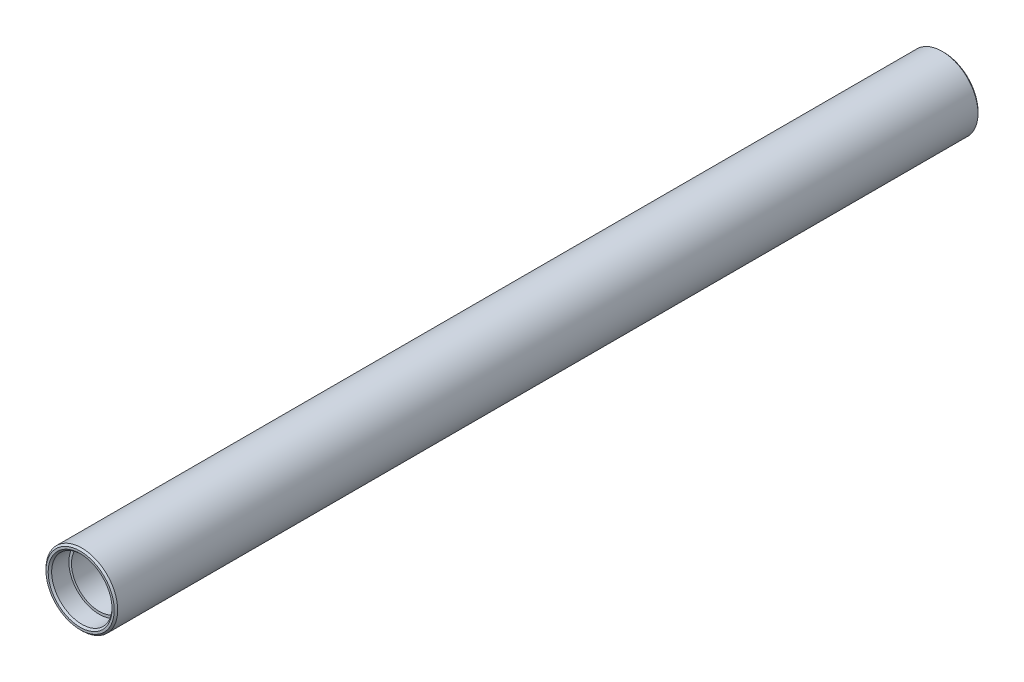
ISO-10303-21;
HEADER;
FILE_DESCRIPTION(('STEP AP214'),'2;1');
FILE_NAME('part.step','',(''),(''),'','','');
FILE_SCHEMA(('AUTOMOTIVE_DESIGN { 1 0 10303 214 1 1 1 1 }'));
ENDSEC;
DATA;
#1=APPLICATION_CONTEXT('core data for automotive mechanical design processes');
#2=APPLICATION_PROTOCOL_DEFINITION('international standard','automotive_design',2000,#1);
#3=PRODUCT_CONTEXT('',#1,'mechanical');
#4=PRODUCT('Part','Part','',(#3));
#5=PRODUCT_RELATED_PRODUCT_CATEGORY('part','',(#4));
#6=PRODUCT_DEFINITION_FORMATION('','',#4);
#7=PRODUCT_DEFINITION_CONTEXT('part definition',#1,'design');
#8=PRODUCT_DEFINITION('design','',#6,#7);
#9=PRODUCT_DEFINITION_SHAPE('','',#8);
#10=(LENGTH_UNIT() NAMED_UNIT(*) SI_UNIT(.MILLI.,.METRE.));
#11=(NAMED_UNIT(*) PLANE_ANGLE_UNIT() SI_UNIT($,.RADIAN.));
#12=(NAMED_UNIT(*) SI_UNIT($,.STERADIAN.) SOLID_ANGLE_UNIT());
#13=UNCERTAINTY_MEASURE_WITH_UNIT(LENGTH_MEASURE(1.E-05),#10,'distance_accuracy_value','');
#14=(GEOMETRIC_REPRESENTATION_CONTEXT(3) GLOBAL_UNCERTAINTY_ASSIGNED_CONTEXT((#13)) GLOBAL_UNIT_ASSIGNED_CONTEXT((#10,
#11,#12)) REPRESENTATION_CONTEXT('',''));
#15=CARTESIAN_POINT('',(0.,0.,0.));
#16=DIRECTION('',(0.,0.,1.));
#17=DIRECTION('',(1.,0.,0.));
#18=AXIS2_PLACEMENT_3D('',#15,#16,#17);
#19=CARTESIAN_POINT('',(0.,0.,250.));
#20=DIRECTION('',(0.,0.,-1.));
#21=DIRECTION('',(-1.,0.,0.));
#22=AXIS2_PLACEMENT_3D('',#19,#20,#21);
#23=CYLINDRICAL_SURFACE('',#22,16.);
#24=CARTESIAN_POINT('',(0.,0.,11.));
#25=DIRECTION('',(0.,0.,-1.));
#26=DIRECTION('',(-1.,0.,0.));
#27=AXIS2_PLACEMENT_3D('',#24,#25,#26);
#28=CIRCLE('',#27,16.);
#29=CARTESIAN_POINT('',(-16.,0.,11.));
#30=VERTEX_POINT('',#29);
#31=EDGE_CURVE('E80',#30,#30,#28,.T.);
#32=ORIENTED_EDGE('',*,*,#31,.T.);
#33=EDGE_LOOP('',(#32));
#34=FACE_BOUND('',#33,.T.);
#35=CARTESIAN_POINT('',(0.,0.,489.));
#36=DIRECTION('',(0.,0.,1.));
#37=DIRECTION('',(1.,0.,0.));
#38=AXIS2_PLACEMENT_3D('',#35,#36,#37);
#39=CIRCLE('',#38,16.);
#40=CARTESIAN_POINT('',(16.,0.,489.));
#41=VERTEX_POINT('',#40);
#42=EDGE_CURVE('E64',#41,#41,#39,.T.);
#43=ORIENTED_EDGE('',*,*,#42,.T.);
#44=EDGE_LOOP('',(#43));
#45=FACE_BOUND('',#44,.T.);
#46=ADVANCED_FACE('F40',(#34,#45),#23,.F.);
#47=CARTESIAN_POINT('',(0.,0.,500.));
#48=DIRECTION('',(0.,0.,-1.));
#49=DIRECTION('',(1.,0.,0.));
#50=AXIS2_PLACEMENT_3D('',#47,#48,#49);
#51=PLANE('',#50);
#52=CARTESIAN_POINT('',(0.,0.,500.));
#53=DIRECTION('',(0.,0.,-1.));
#54=DIRECTION('',(-1.,0.,0.));
#55=AXIS2_PLACEMENT_3D('',#52,#53,#54);
#56=CIRCLE('',#55,18.5);
#57=CARTESIAN_POINT('',(-18.5,0.,500.));
#58=VERTEX_POINT('',#57);
#59=EDGE_CURVE('E54',#58,#58,#56,.T.);
#60=ORIENTED_EDGE('',*,*,#59,.T.);
#61=EDGE_LOOP('',(#60));
#62=FACE_BOUND('',#61,.T.);
#63=CARTESIAN_POINT('',(0.,0.,500.));
#64=DIRECTION('',(0.,0.,-1.));
#65=DIRECTION('',(-1.,0.,0.));
#66=AXIS2_PLACEMENT_3D('',#63,#64,#65);
#67=CIRCLE('',#66,19.75);
#68=CARTESIAN_POINT('',(-19.75,0.,500.));
#69=VERTEX_POINT('',#68);
#70=EDGE_CURVE('E58',#69,#69,#67,.F.);
#71=ORIENTED_EDGE('',*,*,#70,.T.);
#72=EDGE_LOOP('',(#71));
#73=FACE_BOUND('',#72,.T.);
#74=ADVANCED_FACE('F104',(#62,#73),#51,.F.);
#75=CARTESIAN_POINT('',(0.,0.,0.));
#76=DIRECTION('',(0.,0.,1.));
#77=DIRECTION('',(1.,0.,0.));
#78=AXIS2_PLACEMENT_3D('',#75,#76,#77);
#79=PLANE('',#78);
#80=CARTESIAN_POINT('',(0.,0.,0.));
#81=DIRECTION('',(0.,0.,1.));
#82=DIRECTION('',(1.,0.,0.));
#83=AXIS2_PLACEMENT_3D('',#80,#81,#82);
#84=CIRCLE('',#83,18.5);
#85=CARTESIAN_POINT('',(18.5,0.,0.));
#86=VERTEX_POINT('',#85);
#87=EDGE_CURVE('E71',#86,#86,#84,.T.);
#88=ORIENTED_EDGE('',*,*,#87,.T.);
#89=EDGE_LOOP('',(#88));
#90=FACE_BOUND('',#89,.T.);
#91=CARTESIAN_POINT('',(0.,0.,0.));
#92=DIRECTION('',(0.,0.,1.));
#93=DIRECTION('',(1.,0.,0.));
#94=AXIS2_PLACEMENT_3D('',#91,#92,#93);
#95=CIRCLE('',#94,19.75);
#96=CARTESIAN_POINT('',(19.75,0.,0.));
#97=VERTEX_POINT('',#96);
#98=EDGE_CURVE('E74',#97,#97,#95,.F.);
#99=ORIENTED_EDGE('',*,*,#98,.T.);
#100=EDGE_LOOP('',(#99));
#101=FACE_BOUND('',#100,.T.);
#102=ADVANCED_FACE('F110',(#90,#101),#79,.F.);
#103=CARTESIAN_POINT('',(0.,0.,250.));
#104=DIRECTION('',(0.,0.,-1.));
#105=DIRECTION('',(-1.,0.,0.));
#106=AXIS2_PLACEMENT_3D('',#103,#104,#105);
#107=CYLINDRICAL_SURFACE('',#106,20.75);
#108=CARTESIAN_POINT('',(0.,0.,499.));
#109=DIRECTION('',(0.,0.,-1.));
#110=DIRECTION('',(-1.,0.,0.));
#111=AXIS2_PLACEMENT_3D('',#108,#109,#110);
#112=CIRCLE('',#111,20.75);
#113=CARTESIAN_POINT('',(-20.75,0.,499.));
#114=VERTEX_POINT('',#113);
#115=EDGE_CURVE('E11',#114,#114,#112,.T.);
#116=ORIENTED_EDGE('',*,*,#115,.T.);
#117=EDGE_LOOP('',(#116));
#118=FACE_BOUND('',#117,.T.);
#119=CARTESIAN_POINT('',(0.,0.,0.999999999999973));
#120=DIRECTION('',(0.,0.,1.));
#121=DIRECTION('',(1.,0.,0.));
#122=AXIS2_PLACEMENT_3D('',#119,#120,#121);
#123=CIRCLE('',#122,20.75);
#124=CARTESIAN_POINT('',(20.75,0.,0.999999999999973));
#125=VERTEX_POINT('',#124);
#126=EDGE_CURVE('E63',#125,#125,#123,.T.);
#127=ORIENTED_EDGE('',*,*,#126,.T.);
#128=EDGE_LOOP('',(#127));
#129=FACE_BOUND('',#128,.T.);
#130=ADVANCED_FACE('F120',(#118,#129),#107,.T.);
#131=CARTESIAN_POINT('',(0.,0.,11.));
#132=DIRECTION('',(0.,0.,-1.));
#133=DIRECTION('',(-1.,0.,0.));
#134=AXIS2_PLACEMENT_3D('',#131,#132,#133);
#135=CYLINDRICAL_SURFACE('',#134,17.5);
#136=CARTESIAN_POINT('',(0.,0.,0.999999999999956));
#137=DIRECTION('',(0.,0.,1.));
#138=DIRECTION('',(1.,0.,0.));
#139=AXIS2_PLACEMENT_3D('',#136,#137,#138);
#140=CIRCLE('',#139,17.5);
#141=CARTESIAN_POINT('',(17.5,0.,0.999999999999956));
#142=VERTEX_POINT('',#141);
#143=EDGE_CURVE('E77',#142,#142,#140,.F.);
#144=ORIENTED_EDGE('',*,*,#143,.T.);
#145=EDGE_LOOP('',(#144));
#146=FACE_BOUND('',#145,.T.);
#147=CARTESIAN_POINT('',(0.,0.,11.));
#148=DIRECTION('',(0.,0.,-1.));
#149=DIRECTION('',(-1.,0.,0.));
#150=AXIS2_PLACEMENT_3D('',#147,#148,#149);
#151=CIRCLE('',#150,17.5);
#152=CARTESIAN_POINT('',(-17.5,0.,11.));
#153=VERTEX_POINT('',#152);
#154=EDGE_CURVE('E67',#153,#153,#151,.T.);
#155=ORIENTED_EDGE('',*,*,#154,.F.);
#156=EDGE_LOOP('',(#155));
#157=FACE_BOUND('',#156,.T.);
#158=ADVANCED_FACE('F116',(#146,#157),#135,.F.);
#159=CARTESIAN_POINT('',(0.,0.,11.));
#160=DIRECTION('',(0.,0.,-1.));
#161=DIRECTION('',(-1.,0.,0.));
#162=AXIS2_PLACEMENT_3D('',#159,#160,#161);
#163=PLANE('',#162);
#164=ORIENTED_EDGE('',*,*,#31,.F.);
#165=EDGE_LOOP('',(#164));
#166=FACE_BOUND('',#165,.T.);
#167=ORIENTED_EDGE('',*,*,#154,.T.);
#168=EDGE_LOOP('',(#167));
#169=FACE_BOUND('',#168,.T.);
#170=ADVANCED_FACE('F127',(#166,#169),#163,.T.);
#171=CARTESIAN_POINT('',(0.,0.,0.999999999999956));
#172=DIRECTION('',(0.,0.,-1.));
#173=DIRECTION('',(-1.,0.,0.));
#174=AXIS2_PLACEMENT_3D('',#171,#172,#173);
#175=CONICAL_SURFACE('',#174,17.5,0.785398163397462);
#176=ORIENTED_EDGE('',*,*,#87,.F.);
#177=EDGE_LOOP('',(#176));
#178=FACE_BOUND('',#177,.T.);
#179=ORIENTED_EDGE('',*,*,#143,.F.);
#180=EDGE_LOOP('',(#179));
#181=FACE_BOUND('',#180,.T.);
#182=ADVANCED_FACE('F124',(#178,#181),#175,.F.);
#183=CARTESIAN_POINT('',(0.,0.,0.999999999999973));
#184=DIRECTION('',(0.,0.,1.));
#185=DIRECTION('',(1.,0.,0.));
#186=AXIS2_PLACEMENT_3D('',#183,#184,#185);
#187=CONICAL_SURFACE('',#186,20.75,0.785398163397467);
#188=ORIENTED_EDGE('',*,*,#98,.F.);
#189=EDGE_LOOP('',(#188));
#190=FACE_BOUND('',#189,.T.);
#191=ORIENTED_EDGE('',*,*,#126,.F.);
#192=EDGE_LOOP('',(#191));
#193=FACE_BOUND('',#192,.T.);
#194=ADVANCED_FACE('F100',(#190,#193),#187,.T.);
#195=CARTESIAN_POINT('',(0.,0.,489.));
#196=DIRECTION('',(0.,0.,1.));
#197=DIRECTION('',(1.,0.,0.));
#198=AXIS2_PLACEMENT_3D('',#195,#196,#197);
#199=CYLINDRICAL_SURFACE('',#198,17.5);
#200=CARTESIAN_POINT('',(0.,0.,499.));
#201=DIRECTION('',(0.,0.,-1.));
#202=DIRECTION('',(-1.,0.,0.));
#203=AXIS2_PLACEMENT_3D('',#200,#201,#202);
#204=CIRCLE('',#203,17.5);
#205=CARTESIAN_POINT('',(-17.5,0.,499.));
#206=VERTEX_POINT('',#205);
#207=EDGE_CURVE('E49',#206,#206,#204,.F.);
#208=ORIENTED_EDGE('',*,*,#207,.T.);
#209=EDGE_LOOP('',(#208));
#210=FACE_BOUND('',#209,.T.);
#211=CARTESIAN_POINT('',(0.,0.,489.));
#212=DIRECTION('',(0.,0.,-1.));
#213=DIRECTION('',(-1.,0.,0.));
#214=AXIS2_PLACEMENT_3D('',#211,#212,#213);
#215=CIRCLE('',#214,17.5);
#216=CARTESIAN_POINT('',(-17.5,0.,489.));
#217=VERTEX_POINT('',#216);
#218=EDGE_CURVE('E68',#217,#217,#215,.T.);
#219=ORIENTED_EDGE('',*,*,#218,.T.);
#220=EDGE_LOOP('',(#219));
#221=FACE_BOUND('',#220,.T.);
#222=ADVANCED_FACE('F88',(#210,#221),#199,.F.);
#223=CARTESIAN_POINT('',(0.,0.,489.));
#224=DIRECTION('',(0.,0.,1.));
#225=DIRECTION('',(-1.,0.,0.));
#226=AXIS2_PLACEMENT_3D('',#223,#224,#225);
#227=PLANE('',#226);
#228=ORIENTED_EDGE('',*,*,#42,.F.);
#229=EDGE_LOOP('',(#228));
#230=FACE_BOUND('',#229,.T.);
#231=ORIENTED_EDGE('',*,*,#218,.F.);
#232=EDGE_LOOP('',(#231));
#233=FACE_BOUND('',#232,.T.);
#234=ADVANCED_FACE('F90',(#230,#233),#227,.T.);
#235=CARTESIAN_POINT('',(0.,0.,500.));
#236=DIRECTION('',(0.,0.,1.));
#237=DIRECTION('',(1.,0.,0.));
#238=AXIS2_PLACEMENT_3D('',#235,#236,#237);
#239=CONICAL_SURFACE('',#238,18.5,0.785398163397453);
#240=ORIENTED_EDGE('',*,*,#207,.F.);
#241=EDGE_LOOP('',(#240));
#242=FACE_BOUND('',#241,.T.);
#243=ORIENTED_EDGE('',*,*,#59,.F.);
#244=EDGE_LOOP('',(#243));
#245=FACE_BOUND('',#244,.T.);
#246=ADVANCED_FACE('F92',(#242,#245),#239,.F.);
#247=CARTESIAN_POINT('',(0.,0.,500.));
#248=DIRECTION('',(0.,0.,-1.));
#249=DIRECTION('',(-1.,0.,0.));
#250=AXIS2_PLACEMENT_3D('',#247,#248,#249);
#251=CONICAL_SURFACE('',#250,19.75,0.785398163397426);
#252=ORIENTED_EDGE('',*,*,#115,.F.);
#253=EDGE_LOOP('',(#252));
#254=FACE_BOUND('',#253,.T.);
#255=ORIENTED_EDGE('',*,*,#70,.F.);
#256=EDGE_LOOP('',(#255));
#257=FACE_BOUND('',#256,.T.);
#258=ADVANCED_FACE('F42',(#254,#257),#251,.T.);
#259=CLOSED_SHELL('',(#46,#74,#102,#130,#158,#170,#182,#194,#222,#234,#246,#258));
#260=MANIFOLD_SOLID_BREP('B2',#259);
#261=ADVANCED_BREP_SHAPE_REPRESENTATION('',(#18,#260),#14);
#262=SHAPE_DEFINITION_REPRESENTATION(#9,#261);
ENDSEC;
END-ISO-10303-21;
